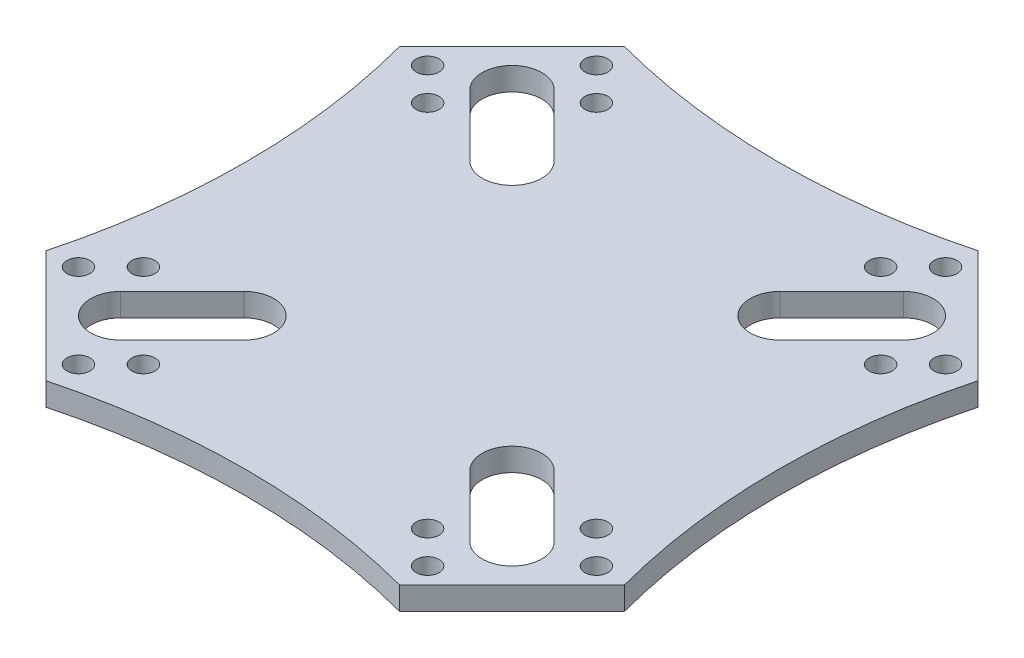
ISO-10303-21;
HEADER;
FILE_DESCRIPTION(('STEP AP214'),'2;1');
FILE_NAME('part.step','',(''),(''),'','','');
FILE_SCHEMA(('AUTOMOTIVE_DESIGN { 1 0 10303 214 1 1 1 1 }'));
ENDSEC;
DATA;
#1=APPLICATION_CONTEXT('core data for automotive mechanical design processes');
#2=APPLICATION_PROTOCOL_DEFINITION('international standard','automotive_design',2000,#1);
#3=PRODUCT_CONTEXT('',#1,'mechanical');
#4=PRODUCT('Part','Part','',(#3));
#5=PRODUCT_RELATED_PRODUCT_CATEGORY('part','',(#4));
#6=PRODUCT_DEFINITION_FORMATION('','',#4);
#7=PRODUCT_DEFINITION_CONTEXT('part definition',#1,'design');
#8=PRODUCT_DEFINITION('design','',#6,#7);
#9=PRODUCT_DEFINITION_SHAPE('','',#8);
#10=(LENGTH_UNIT() NAMED_UNIT(*) SI_UNIT(.MILLI.,.METRE.));
#11=(NAMED_UNIT(*) PLANE_ANGLE_UNIT() SI_UNIT($,.RADIAN.));
#12=(NAMED_UNIT(*) SI_UNIT($,.STERADIAN.) SOLID_ANGLE_UNIT());
#13=UNCERTAINTY_MEASURE_WITH_UNIT(LENGTH_MEASURE(1.E-05),#10,'distance_accuracy_value','');
#14=(GEOMETRIC_REPRESENTATION_CONTEXT(3) GLOBAL_UNCERTAINTY_ASSIGNED_CONTEXT((#13)) GLOBAL_UNIT_ASSIGNED_CONTEXT((#10,
#11,#12)) REPRESENTATION_CONTEXT('',''));
#15=CARTESIAN_POINT('',(0.,0.,0.));
#16=DIRECTION('',(0.,0.,1.));
#17=DIRECTION('',(1.,0.,0.));
#18=AXIS2_PLACEMENT_3D('',#15,#16,#17);
#19=CARTESIAN_POINT('',(0.,2.5,-208.));
#20=DIRECTION('',(0.,1.,0.));
#21=DIRECTION('',(0.,0.,1.));
#22=AXIS2_PLACEMENT_3D('',#19,#20,#21);
#23=PLANE('',#22);
#24=CARTESIAN_POINT('',(56.4193553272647,2.5,38.0345790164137));
#25=DIRECTION('',(0.,1.,0.));
#26=DIRECTION('',(-1.,0.,0.));
#27=AXIS2_PLACEMENT_3D('',#24,#25,#26);
#28=CIRCLE('',#27,2.50000000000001);
#29=CARTESIAN_POINT('',(53.9193553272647,2.5,38.0345790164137));
#30=VERTEX_POINT('',#29);
#31=EDGE_CURVE('E850',#30,#30,#28,.T.);
#32=ORIENTED_EDGE('',*,*,#31,.F.);
#33=EDGE_LOOP('',(#32));
#34=FACE_BOUND('',#33,.T.);
#35=CARTESIAN_POINT('',(38.0345790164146,2.5,56.4193553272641));
#36=DIRECTION('',(0.,1.,0.));
#37=DIRECTION('',(-1.,0.,0.));
#38=AXIS2_PLACEMENT_3D('',#35,#36,#37);
#39=CIRCLE('',#38,2.50000000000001);
#40=CARTESIAN_POINT('',(35.5345790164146,2.5,56.4193553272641));
#41=VERTEX_POINT('',#40);
#42=EDGE_CURVE('E859',#41,#41,#39,.T.);
#43=ORIENTED_EDGE('',*,*,#42,.F.);
#44=EDGE_LOOP('',(#43));
#45=FACE_BOUND('',#44,.T.);
#46=CARTESIAN_POINT('',(49.3482875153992,2.5,30.9635112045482));
#47=DIRECTION('',(0.,1.,0.));
#48=DIRECTION('',(-1.,0.,0.));
#49=AXIS2_PLACEMENT_3D('',#46,#47,#48);
#50=CIRCLE('',#49,2.50000000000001);
#51=CARTESIAN_POINT('',(46.8482875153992,2.5,30.9635112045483));
#52=VERTEX_POINT('',#51);
#53=EDGE_CURVE('E869',#52,#52,#50,.T.);
#54=ORIENTED_EDGE('',*,*,#53,.F.);
#55=EDGE_LOOP('',(#54));
#56=FACE_BOUND('',#55,.T.);
#57=CARTESIAN_POINT('',(30.9635112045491,2.5,49.3482875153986));
#58=DIRECTION('',(0.,1.,0.));
#59=DIRECTION('',(-1.,0.,0.));
#60=AXIS2_PLACEMENT_3D('',#57,#58,#59);
#61=CIRCLE('',#60,2.50000000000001);
#62=CARTESIAN_POINT('',(28.4635112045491,2.5,49.3482875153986));
#63=VERTEX_POINT('',#62);
#64=EDGE_CURVE('E877',#63,#63,#61,.T.);
#65=ORIENTED_EDGE('',*,*,#64,.F.);
#66=EDGE_LOOP('',(#65));
#67=FACE_BOUND('',#66,.T.);
#68=CARTESIAN_POINT('',(-38.0345790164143,2.5,56.4193553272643));
#69=DIRECTION('',(0.,1.,0.));
#70=DIRECTION('',(0.,0.,-1.));
#71=AXIS2_PLACEMENT_3D('',#68,#69,#70);
#72=CIRCLE('',#71,2.50000000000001);
#73=CARTESIAN_POINT('',(-38.0345790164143,2.5,53.9193553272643));
#74=VERTEX_POINT('',#73);
#75=EDGE_CURVE('E886',#74,#74,#72,.T.);
#76=ORIENTED_EDGE('',*,*,#75,.F.);
#77=EDGE_LOOP('',(#76));
#78=FACE_BOUND('',#77,.T.);
#79=CARTESIAN_POINT('',(-56.4193553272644,2.5,38.034579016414));
#80=DIRECTION('',(0.,1.,0.));
#81=DIRECTION('',(0.,0.,-1.));
#82=AXIS2_PLACEMENT_3D('',#79,#80,#81);
#83=CIRCLE('',#82,2.50000000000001);
#84=CARTESIAN_POINT('',(-56.4193553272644,2.5,35.534579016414));
#85=VERTEX_POINT('',#84);
#86=EDGE_CURVE('E894',#85,#85,#83,.T.);
#87=ORIENTED_EDGE('',*,*,#86,.F.);
#88=EDGE_LOOP('',(#87));
#89=FACE_BOUND('',#88,.T.);
#90=CARTESIAN_POINT('',(-30.9635112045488,2.5,49.3482875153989));
#91=DIRECTION('',(0.,1.,0.));
#92=DIRECTION('',(0.,0.,-1.));
#93=AXIS2_PLACEMENT_3D('',#90,#91,#92);
#94=CIRCLE('',#93,2.50000000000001);
#95=CARTESIAN_POINT('',(-30.9635112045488,2.5,46.8482875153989));
#96=VERTEX_POINT('',#95);
#97=EDGE_CURVE('E902',#96,#96,#94,.T.);
#98=ORIENTED_EDGE('',*,*,#97,.F.);
#99=EDGE_LOOP('',(#98));
#100=FACE_BOUND('',#99,.T.);
#101=CARTESIAN_POINT('',(-49.3482875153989,2.5,30.9635112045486));
#102=DIRECTION('',(0.,1.,0.));
#103=DIRECTION('',(0.,0.,-1.));
#104=AXIS2_PLACEMENT_3D('',#101,#102,#103);
#105=CIRCLE('',#104,2.50000000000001);
#106=CARTESIAN_POINT('',(-49.3482875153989,2.5,28.4635112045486));
#107=VERTEX_POINT('',#106);
#108=EDGE_CURVE('E856',#107,#107,#105,.T.);
#109=ORIENTED_EDGE('',*,*,#108,.F.);
#110=EDGE_LOOP('',(#109));
#111=FACE_BOUND('',#110,.T.);
#112=CARTESIAN_POINT('',(-56.4193553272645,2.5,-38.0345790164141));
#113=DIRECTION('',(0.,1.,0.));
#114=DIRECTION('',(1.,0.,0.));
#115=AXIS2_PLACEMENT_3D('',#112,#113,#114);
#116=CIRCLE('',#115,2.50000000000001);
#117=CARTESIAN_POINT('',(-53.9193553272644,2.5,-38.0345790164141));
#118=VERTEX_POINT('',#117);
#119=EDGE_CURVE('E918',#118,#118,#116,.T.);
#120=ORIENTED_EDGE('',*,*,#119,.F.);
#121=EDGE_LOOP('',(#120));
#122=FACE_BOUND('',#121,.T.);
#123=CARTESIAN_POINT('',(-38.0345790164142,2.5,-56.4193553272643));
#124=DIRECTION('',(0.,1.,0.));
#125=DIRECTION('',(1.,0.,0.));
#126=AXIS2_PLACEMENT_3D('',#123,#124,#125);
#127=CIRCLE('',#126,2.50000000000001);
#128=CARTESIAN_POINT('',(-35.5345790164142,2.5,-56.4193553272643));
#129=VERTEX_POINT('',#128);
#130=EDGE_CURVE('E926',#129,#129,#127,.T.);
#131=ORIENTED_EDGE('',*,*,#130,.F.);
#132=EDGE_LOOP('',(#131));
#133=FACE_BOUND('',#132,.T.);
#134=CARTESIAN_POINT('',(-49.348287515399,2.5,-30.9635112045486));
#135=DIRECTION('',(0.,1.,0.));
#136=DIRECTION('',(1.,0.,0.));
#137=AXIS2_PLACEMENT_3D('',#134,#135,#136);
#138=CIRCLE('',#137,2.50000000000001);
#139=CARTESIAN_POINT('',(-46.848287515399,2.5,-30.9635112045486));
#140=VERTEX_POINT('',#139);
#141=EDGE_CURVE('E934',#140,#140,#138,.T.);
#142=ORIENTED_EDGE('',*,*,#141,.F.);
#143=EDGE_LOOP('',(#142));
#144=FACE_BOUND('',#143,.T.);
#145=CARTESIAN_POINT('',(-30.9635112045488,2.5,-49.3482875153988));
#146=DIRECTION('',(0.,1.,0.));
#147=DIRECTION('',(1.,0.,0.));
#148=AXIS2_PLACEMENT_3D('',#145,#146,#147);
#149=CIRCLE('',#148,2.50000000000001);
#150=CARTESIAN_POINT('',(-28.4635112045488,2.5,-49.3482875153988));
#151=VERTEX_POINT('',#150);
#152=EDGE_CURVE('E885',#151,#151,#149,.T.);
#153=ORIENTED_EDGE('',*,*,#152,.F.);
#154=EDGE_LOOP('',(#153));
#155=FACE_BOUND('',#154,.T.);
#156=CARTESIAN_POINT('',(30.9635112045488,2.5,-49.3482875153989));
#157=DIRECTION('',(0.,1.,0.));
#158=DIRECTION('',(0.,0.,1.));
#159=AXIS2_PLACEMENT_3D('',#156,#157,#158);
#160=CIRCLE('',#159,2.50000000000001);
#161=CARTESIAN_POINT('',(30.9635112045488,2.5,-46.8482875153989));
#162=VERTEX_POINT('',#161);
#163=EDGE_CURVE('E950',#162,#162,#160,.T.);
#164=ORIENTED_EDGE('',*,*,#163,.F.);
#165=EDGE_LOOP('',(#164));
#166=FACE_BOUND('',#165,.T.);
#167=CARTESIAN_POINT('',(49.3482875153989,2.5,-30.9635112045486));
#168=DIRECTION('',(0.,1.,0.));
#169=DIRECTION('',(0.,0.,1.));
#170=AXIS2_PLACEMENT_3D('',#167,#168,#169);
#171=CIRCLE('',#170,2.50000000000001);
#172=CARTESIAN_POINT('',(49.3482875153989,2.5,-28.4635112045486));
#173=VERTEX_POINT('',#172);
#174=EDGE_CURVE('E917',#173,#173,#171,.T.);
#175=ORIENTED_EDGE('',*,*,#174,.F.);
#176=EDGE_LOOP('',(#175));
#177=FACE_BOUND('',#176,.T.);
#178=CARTESIAN_POINT('',(38.0345790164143,2.5,-56.4193553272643));
#179=DIRECTION('',(0.,1.,0.));
#180=DIRECTION('',(0.,0.,1.));
#181=AXIS2_PLACEMENT_3D('',#178,#179,#180);
#182=CIRCLE('',#181,2.50000000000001);
#183=CARTESIAN_POINT('',(38.0345790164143,2.5,-53.9193553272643));
#184=VERTEX_POINT('',#183);
#185=EDGE_CURVE('E964',#184,#184,#182,.T.);
#186=ORIENTED_EDGE('',*,*,#185,.F.);
#187=EDGE_LOOP('',(#186));
#188=FACE_BOUND('',#187,.T.);
#189=CARTESIAN_POINT('',(56.4193553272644,2.5,-38.034579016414));
#190=DIRECTION('',(0.,1.,0.));
#191=DIRECTION('',(0.,0.,1.));
#192=AXIS2_PLACEMENT_3D('',#189,#190,#191);
#193=CIRCLE('',#192,2.50000000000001);
#194=CARTESIAN_POINT('',(56.4193553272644,2.5,-35.534579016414));
#195=VERTEX_POINT('',#194);
#196=EDGE_CURVE('E949',#195,#195,#193,.T.);
#197=ORIENTED_EDGE('',*,*,#196,.F.);
#198=EDGE_LOOP('',(#197));
#199=FACE_BOUND('',#198,.T.);
#200=CARTESIAN_POINT('',(0.,2.5,-208.));
#201=DIRECTION('',(0.,-1.,0.));
#202=DIRECTION('',(0.,0.,1.));
#203=AXIS2_PLACEMENT_3D('',#200,#201,#202);
#204=CIRCLE('',#203,150.);
#205=CARTESIAN_POINT('',(38.5,2.5,-63.0250021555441));
#206=VERTEX_POINT('',#205);
#207=CARTESIAN_POINT('',(-38.5,2.5,-63.0250021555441));
#208=VERTEX_POINT('',#207);
#209=EDGE_CURVE('E379',#206,#208,#204,.T.);
#210=ORIENTED_EDGE('',*,*,#209,.T.);
#211=DIRECTION('',(-0.707106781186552,0.,0.707106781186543));
#212=VECTOR('',#211,1.);
#213=CARTESIAN_POINT('',(-63.0250021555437,2.5,-38.5000000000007));
#214=LINE('',#213,#212);
#215=CARTESIAN_POINT('',(-63.0250021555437,2.5,-38.5000000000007));
#216=VERTEX_POINT('',#215);
#217=EDGE_CURVE('E383',#208,#216,#214,.T.);
#218=ORIENTED_EDGE('',*,*,#217,.T.);
#219=CARTESIAN_POINT('',(-208.,2.5,-2.187357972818E-12));
#220=DIRECTION('',(0.,-1.,0.));
#221=DIRECTION('',(0.,0.,1.));
#222=AXIS2_PLACEMENT_3D('',#219,#220,#221);
#223=CIRCLE('',#222,150.);
#224=CARTESIAN_POINT('',(-63.0250021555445,2.5,38.4999999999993));
#225=VERTEX_POINT('',#224);
#226=EDGE_CURVE('E387',#216,#225,#223,.T.);
#227=ORIENTED_EDGE('',*,*,#226,.T.);
#228=DIRECTION('',(0.707106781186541,0.,0.707106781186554));
#229=VECTOR('',#228,1.);
#230=CARTESIAN_POINT('',(-38.5000000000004,2.5,63.0250021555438));
#231=LINE('',#230,#229);
#232=CARTESIAN_POINT('',(-38.5000000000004,2.5,63.0250021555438));
#233=VERTEX_POINT('',#232);
#234=EDGE_CURVE('E390',#225,#233,#231,.T.);
#235=ORIENTED_EDGE('',*,*,#234,.T.);
#236=CARTESIAN_POINT('',(-1.45072151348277E-12,2.5,208.));
#237=DIRECTION('',(0.,-1.,0.));
#238=DIRECTION('',(0.,0.,1.));
#239=AXIS2_PLACEMENT_3D('',#236,#237,#238);
#240=CIRCLE('',#239,150.);
#241=CARTESIAN_POINT('',(38.4999999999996,2.5,63.0250021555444));
#242=VERTEX_POINT('',#241);
#243=EDGE_CURVE('E393',#233,#242,#240,.T.);
#244=ORIENTED_EDGE('',*,*,#243,.T.);
#245=DIRECTION('',(0.707106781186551,0.,-0.707106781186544));
#246=VECTOR('',#245,1.);
#247=CARTESIAN_POINT('',(63.0250021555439,2.5,38.5000000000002));
#248=LINE('',#247,#246);
#249=CARTESIAN_POINT('',(63.0250021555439,2.5,38.5000000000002));
#250=VERTEX_POINT('',#249);
#251=EDGE_CURVE('E396',#242,#250,#248,.T.);
#252=ORIENTED_EDGE('',*,*,#251,.T.);
#253=CARTESIAN_POINT('',(208.,2.5,7.38371182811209E-13));
#254=DIRECTION('',(0.,-1.,0.));
#255=DIRECTION('',(0.,0.,1.));
#256=AXIS2_PLACEMENT_3D('',#253,#254,#255);
#257=CIRCLE('',#256,150.);
#258=CARTESIAN_POINT('',(63.0250021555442,2.5,-38.4999999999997));
#259=VERTEX_POINT('',#258);
#260=EDGE_CURVE('E399',#250,#259,#257,.T.);
#261=ORIENTED_EDGE('',*,*,#260,.T.);
#262=DIRECTION('',(-0.707106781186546,0.,-0.707106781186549));
#263=VECTOR('',#262,1.);
#264=CARTESIAN_POINT('',(38.5,2.5,-63.0250021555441));
#265=LINE('',#264,#263);
#266=EDGE_CURVE('E402',#259,#206,#265,.T.);
#267=ORIENTED_EDGE('',*,*,#266,.T.);
#268=EDGE_LOOP('',(#210,#218,#227,#235,#244,#252,#261,#267));
#269=FACE_BOUND('',#268,.T.);
#270=DIRECTION('',(0.707106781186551,0.,-0.707106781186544));
#271=VECTOR('',#270,1.);
#272=CARTESIAN_POINT('',(33.7919383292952,2.5,-24.5995501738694));
#273=LINE('',#272,#271);
#274=CARTESIAN_POINT('',(33.7919383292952,2.5,-24.5995501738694));
#275=VERTEX_POINT('',#274);
#276=CARTESIAN_POINT('',(47.2269671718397,2.5,-38.0345790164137));
#277=VERTEX_POINT('',#276);
#278=EDGE_CURVE('E339',#275,#277,#273,.T.);
#279=ORIENTED_EDGE('',*,*,#278,.F.);
#280=CARTESIAN_POINT('',(29.1957442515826,2.5,-29.195744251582));
#281=DIRECTION('',(0.,1.,0.));
#282=DIRECTION('',(0.,0.,1.));
#283=AXIS2_PLACEMENT_3D('',#280,#281,#282);
#284=CIRCLE('',#283,6.50000000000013);
#285=CARTESIAN_POINT('',(24.59955017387,2.5,-33.7919383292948));
#286=VERTEX_POINT('',#285);
#287=EDGE_CURVE('E336',#286,#275,#284,.T.);
#288=ORIENTED_EDGE('',*,*,#287,.F.);
#289=DIRECTION('',(-0.707106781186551,0.,0.707106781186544));
#290=VECTOR('',#289,1.);
#291=CARTESIAN_POINT('',(24.59955017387,2.5,-33.7919383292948));
#292=LINE('',#291,#290);
#293=CARTESIAN_POINT('',(38.0345790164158,2.5,-47.2269671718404));
#294=VERTEX_POINT('',#293);
#295=EDGE_CURVE('E347',#294,#286,#292,.T.);
#296=ORIENTED_EDGE('',*,*,#295,.F.);
#297=CARTESIAN_POINT('',(42.6307730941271,2.5,-42.6307730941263));
#298=DIRECTION('',(0.,1.,0.));
#299=DIRECTION('',(0.,0.,1.));
#300=AXIS2_PLACEMENT_3D('',#297,#298,#299);
#301=CIRCLE('',#300,6.50000000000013);
#302=EDGE_CURVE('E343',#277,#294,#301,.T.);
#303=ORIENTED_EDGE('',*,*,#302,.F.);
#304=EDGE_LOOP('',(#279,#288,#296,#303));
#305=FACE_BOUND('',#304,.T.);
#306=DIRECTION('',(0.707106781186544,0.,0.707106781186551));
#307=VECTOR('',#306,1.);
#308=CARTESIAN_POINT('',(24.5995501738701,2.5,33.7919383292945));
#309=LINE('',#308,#307);
#310=CARTESIAN_POINT('',(24.5995501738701,2.5,33.7919383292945));
#311=VERTEX_POINT('',#310);
#312=CARTESIAN_POINT('',(38.034579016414,2.5,47.2269671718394));
#313=VERTEX_POINT('',#312);
#314=EDGE_CURVE('E296',#311,#313,#309,.T.);
#315=ORIENTED_EDGE('',*,*,#314,.F.);
#316=CARTESIAN_POINT('',(29.195744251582,2.5,29.1957442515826));
#317=DIRECTION('',(0.,1.,0.));
#318=DIRECTION('',(0.,0.,1.));
#319=AXIS2_PLACEMENT_3D('',#316,#317,#318);
#320=CIRCLE('',#319,6.49999999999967);
#321=CARTESIAN_POINT('',(33.7919383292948,2.5,24.59955017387));
#322=VERTEX_POINT('',#321);
#323=EDGE_CURVE('E293',#322,#311,#320,.T.);
#324=ORIENTED_EDGE('',*,*,#323,.F.);
#325=DIRECTION('',(-0.707106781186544,0.,-0.707106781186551));
#326=VECTOR('',#325,1.);
#327=CARTESIAN_POINT('',(33.7919383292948,2.5,24.59955017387));
#328=LINE('',#327,#326);
#329=CARTESIAN_POINT('',(47.2269671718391,2.5,38.0345790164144));
#330=VERTEX_POINT('',#329);
#331=EDGE_CURVE('E304',#330,#322,#328,.T.);
#332=ORIENTED_EDGE('',*,*,#331,.F.);
#333=CARTESIAN_POINT('',(42.6307730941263,2.5,42.6307730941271));
#334=DIRECTION('',(0.,1.,0.));
#335=DIRECTION('',(0.,0.,1.));
#336=AXIS2_PLACEMENT_3D('',#333,#334,#335);
#337=CIRCLE('',#336,6.49999999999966);
#338=EDGE_CURVE('E300',#313,#330,#337,.T.);
#339=ORIENTED_EDGE('',*,*,#338,.F.);
#340=EDGE_LOOP('',(#315,#324,#332,#339));
#341=FACE_BOUND('',#340,.T.);
#342=DIRECTION('',(-0.707106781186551,0.,0.707106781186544));
#343=VECTOR('',#342,1.);
#344=CARTESIAN_POINT('',(-33.7919383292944,2.5,24.5995501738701));
#345=LINE('',#344,#343);
#346=CARTESIAN_POINT('',(-33.7919383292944,2.5,24.5995501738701));
#347=VERTEX_POINT('',#346);
#348=CARTESIAN_POINT('',(-47.2269671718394,2.5,38.0345790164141));
#349=VERTEX_POINT('',#348);
#350=EDGE_CURVE('E253',#347,#349,#345,.T.);
#351=ORIENTED_EDGE('',*,*,#350,.F.);
#352=CARTESIAN_POINT('',(-29.1957442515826,2.5,29.195744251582));
#353=DIRECTION('',(0.,1.,0.));
#354=DIRECTION('',(0.,0.,1.));
#355=AXIS2_PLACEMENT_3D('',#352,#353,#354);
#356=CIRCLE('',#355,6.49999999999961);
#357=CARTESIAN_POINT('',(-24.5995501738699,2.5,33.7919383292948));
#358=VERTEX_POINT('',#357);
#359=EDGE_CURVE('E250',#358,#347,#356,.T.);
#360=ORIENTED_EDGE('',*,*,#359,.F.);
#361=DIRECTION('',(0.707106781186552,0.,-0.707106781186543));
#362=VECTOR('',#361,1.);
#363=CARTESIAN_POINT('',(-24.5995501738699,2.5,33.7919383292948));
#364=LINE('',#363,#362);
#365=CARTESIAN_POINT('',(-38.0345790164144,2.5,47.2269671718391));
#366=VERTEX_POINT('',#365);
#367=EDGE_CURVE('E261',#366,#358,#364,.T.);
#368=ORIENTED_EDGE('',*,*,#367,.F.);
#369=CARTESIAN_POINT('',(-42.6307730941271,2.5,42.6307730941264));
#370=DIRECTION('',(0.,1.,0.));
#371=DIRECTION('',(0.,0.,1.));
#372=AXIS2_PLACEMENT_3D('',#369,#370,#371);
#373=CIRCLE('',#372,6.49999999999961);
#374=EDGE_CURVE('E257',#349,#366,#373,.T.);
#375=ORIENTED_EDGE('',*,*,#374,.F.);
#376=EDGE_LOOP('',(#351,#360,#368,#375));
#377=FACE_BOUND('',#376,.T.);
#378=DIRECTION('',(-0.707106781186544,0.,-0.707106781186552));
#379=VECTOR('',#378,1.);
#380=CARTESIAN_POINT('',(-24.5995501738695,2.5,-33.7919383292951));
#381=LINE('',#380,#379);
#382=CARTESIAN_POINT('',(-24.5995501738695,2.5,-33.7919383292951));
#383=VERTEX_POINT('',#382);
#384=CARTESIAN_POINT('',(-38.0345790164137,2.5,-47.2269671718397));
#385=VERTEX_POINT('',#384);
#386=EDGE_CURVE('E209',#383,#385,#381,.T.);
#387=ORIENTED_EDGE('',*,*,#386,.F.);
#388=CARTESIAN_POINT('',(-29.195744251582,2.5,-29.1957442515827));
#389=DIRECTION('',(0.,1.,0.));
#390=DIRECTION('',(0.,0.,1.));
#391=AXIS2_PLACEMENT_3D('',#388,#389,#390);
#392=CIRCLE('',#391,6.50000000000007);
#393=CARTESIAN_POINT('',(-33.7919383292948,2.5,-24.59955017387));
#394=VERTEX_POINT('',#393);
#395=EDGE_CURVE('E200',#394,#383,#392,.T.);
#396=ORIENTED_EDGE('',*,*,#395,.F.);
#397=DIRECTION('',(0.707106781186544,0.,0.707106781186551));
#398=VECTOR('',#397,1.);
#399=CARTESIAN_POINT('',(-33.7919383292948,2.5,-24.59955017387));
#400=LINE('',#399,#398);
#401=CARTESIAN_POINT('',(-47.2269671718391,2.5,-38.0345790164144));
#402=VERTEX_POINT('',#401);
#403=EDGE_CURVE('E226',#402,#394,#400,.T.);
#404=ORIENTED_EDGE('',*,*,#403,.F.);
#405=CARTESIAN_POINT('',(-42.6307730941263,2.5,-42.6307730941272));
#406=DIRECTION('',(0.,1.,0.));
#407=DIRECTION('',(0.,0.,1.));
#408=AXIS2_PLACEMENT_3D('',#405,#406,#407);
#409=CIRCLE('',#408,6.50000000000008);
#410=EDGE_CURVE('E222',#385,#402,#409,.T.);
#411=ORIENTED_EDGE('',*,*,#410,.F.);
#412=EDGE_LOOP('',(#387,#396,#404,#411));
#413=FACE_BOUND('',#412,.T.);
#414=ADVANCED_FACE('F38',(#34,#45,#56,#67,#78,#89,#100,#111,#122,#133,#144,#155,#166,#177,#188,
#199,#269,#305,#341,#377,#413),#23,.T.);
#415=CARTESIAN_POINT('',(0.,-2.5,-208.));
#416=DIRECTION('',(0.,1.,0.));
#417=DIRECTION('',(0.,0.,1.));
#418=AXIS2_PLACEMENT_3D('',#415,#416,#417);
#419=PLANE('',#418);
#420=CARTESIAN_POINT('',(56.4193553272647,-2.5,38.0345790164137));
#421=DIRECTION('',(0.,1.,0.));
#422=DIRECTION('',(-1.,0.,0.));
#423=AXIS2_PLACEMENT_3D('',#420,#421,#422);
#424=CIRCLE('',#423,2.50000000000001);
#425=CARTESIAN_POINT('',(53.9193553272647,-2.5,38.0345790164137));
#426=VERTEX_POINT('',#425);
#427=EDGE_CURVE('E848',#426,#426,#424,.T.);
#428=ORIENTED_EDGE('',*,*,#427,.T.);
#429=EDGE_LOOP('',(#428));
#430=FACE_BOUND('',#429,.T.);
#431=CARTESIAN_POINT('',(38.0345790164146,-2.5,56.4193553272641));
#432=DIRECTION('',(0.,1.,0.));
#433=DIRECTION('',(-1.,0.,0.));
#434=AXIS2_PLACEMENT_3D('',#431,#432,#433);
#435=CIRCLE('',#434,2.50000000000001);
#436=CARTESIAN_POINT('',(35.5345790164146,-2.5,56.4193553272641));
#437=VERTEX_POINT('',#436);
#438=EDGE_CURVE('E852',#437,#437,#435,.T.);
#439=ORIENTED_EDGE('',*,*,#438,.T.);
#440=EDGE_LOOP('',(#439));
#441=FACE_BOUND('',#440,.T.);
#442=CARTESIAN_POINT('',(49.3482875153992,-2.5,30.9635112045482));
#443=DIRECTION('',(0.,1.,0.));
#444=DIRECTION('',(-1.,0.,0.));
#445=AXIS2_PLACEMENT_3D('',#442,#443,#444);
#446=CIRCLE('',#445,2.50000000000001);
#447=CARTESIAN_POINT('',(46.8482875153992,-2.5,30.9635112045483));
#448=VERTEX_POINT('',#447);
#449=EDGE_CURVE('E865',#448,#448,#446,.T.);
#450=ORIENTED_EDGE('',*,*,#449,.T.);
#451=EDGE_LOOP('',(#450));
#452=FACE_BOUND('',#451,.T.);
#453=CARTESIAN_POINT('',(30.9635112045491,-2.5,49.3482875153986));
#454=DIRECTION('',(0.,1.,0.));
#455=DIRECTION('',(-1.,0.,0.));
#456=AXIS2_PLACEMENT_3D('',#453,#454,#455);
#457=CIRCLE('',#456,2.50000000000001);
#458=CARTESIAN_POINT('',(28.4635112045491,-2.5,49.3482875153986));
#459=VERTEX_POINT('',#458);
#460=EDGE_CURVE('E873',#459,#459,#457,.T.);
#461=ORIENTED_EDGE('',*,*,#460,.T.);
#462=EDGE_LOOP('',(#461));
#463=FACE_BOUND('',#462,.T.);
#464=CARTESIAN_POINT('',(-38.0345790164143,-2.5,56.4193553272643));
#465=DIRECTION('',(0.,1.,0.));
#466=DIRECTION('',(0.,0.,-1.));
#467=AXIS2_PLACEMENT_3D('',#464,#465,#466);
#468=CIRCLE('',#467,2.50000000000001);
#469=CARTESIAN_POINT('',(-38.0345790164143,-2.5,53.9193553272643));
#470=VERTEX_POINT('',#469);
#471=EDGE_CURVE('E881',#470,#470,#468,.T.);
#472=ORIENTED_EDGE('',*,*,#471,.T.);
#473=EDGE_LOOP('',(#472));
#474=FACE_BOUND('',#473,.T.);
#475=CARTESIAN_POINT('',(-56.4193553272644,-2.5,38.034579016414));
#476=DIRECTION('',(0.,1.,0.));
#477=DIRECTION('',(0.,0.,-1.));
#478=AXIS2_PLACEMENT_3D('',#475,#476,#477);
#479=CIRCLE('',#478,2.50000000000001);
#480=CARTESIAN_POINT('',(-56.4193553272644,-2.5,35.534579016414));
#481=VERTEX_POINT('',#480);
#482=EDGE_CURVE('E890',#481,#481,#479,.T.);
#483=ORIENTED_EDGE('',*,*,#482,.T.);
#484=EDGE_LOOP('',(#483));
#485=FACE_BOUND('',#484,.T.);
#486=CARTESIAN_POINT('',(-30.9635112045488,-2.5,49.3482875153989));
#487=DIRECTION('',(0.,1.,0.));
#488=DIRECTION('',(0.,0.,-1.));
#489=AXIS2_PLACEMENT_3D('',#486,#487,#488);
#490=CIRCLE('',#489,2.50000000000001);
#491=CARTESIAN_POINT('',(-30.9635112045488,-2.5,46.8482875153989));
#492=VERTEX_POINT('',#491);
#493=EDGE_CURVE('E898',#492,#492,#490,.T.);
#494=ORIENTED_EDGE('',*,*,#493,.T.);
#495=EDGE_LOOP('',(#494));
#496=FACE_BOUND('',#495,.T.);
#497=CARTESIAN_POINT('',(-49.3482875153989,-2.5,30.9635112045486));
#498=DIRECTION('',(0.,1.,0.));
#499=DIRECTION('',(0.,0.,-1.));
#500=AXIS2_PLACEMENT_3D('',#497,#498,#499);
#501=CIRCLE('',#500,2.50000000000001);
#502=CARTESIAN_POINT('',(-49.3482875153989,-2.5,28.4635112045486));
#503=VERTEX_POINT('',#502);
#504=EDGE_CURVE('E906',#503,#503,#501,.T.);
#505=ORIENTED_EDGE('',*,*,#504,.T.);
#506=EDGE_LOOP('',(#505));
#507=FACE_BOUND('',#506,.T.);
#508=CARTESIAN_POINT('',(-56.4193553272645,-2.5,-38.0345790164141));
#509=DIRECTION('',(0.,1.,0.));
#510=DIRECTION('',(1.,0.,0.));
#511=AXIS2_PLACEMENT_3D('',#508,#509,#510);
#512=CIRCLE('',#511,2.50000000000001);
#513=CARTESIAN_POINT('',(-53.9193553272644,-2.5,-38.0345790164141));
#514=VERTEX_POINT('',#513);
#515=EDGE_CURVE('E913',#514,#514,#512,.T.);
#516=ORIENTED_EDGE('',*,*,#515,.T.);
#517=EDGE_LOOP('',(#516));
#518=FACE_BOUND('',#517,.T.);
#519=CARTESIAN_POINT('',(-38.0345790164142,-2.5,-56.4193553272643));
#520=DIRECTION('',(0.,1.,0.));
#521=DIRECTION('',(1.,0.,0.));
#522=AXIS2_PLACEMENT_3D('',#519,#520,#521);
#523=CIRCLE('',#522,2.50000000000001);
#524=CARTESIAN_POINT('',(-35.5345790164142,-2.5,-56.4193553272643));
#525=VERTEX_POINT('',#524);
#526=EDGE_CURVE('E922',#525,#525,#523,.T.);
#527=ORIENTED_EDGE('',*,*,#526,.T.);
#528=EDGE_LOOP('',(#527));
#529=FACE_BOUND('',#528,.T.);
#530=CARTESIAN_POINT('',(-49.348287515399,-2.5,-30.9635112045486));
#531=DIRECTION('',(0.,1.,0.));
#532=DIRECTION('',(1.,0.,0.));
#533=AXIS2_PLACEMENT_3D('',#530,#531,#532);
#534=CIRCLE('',#533,2.50000000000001);
#535=CARTESIAN_POINT('',(-46.848287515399,-2.5,-30.9635112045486));
#536=VERTEX_POINT('',#535);
#537=EDGE_CURVE('E930',#536,#536,#534,.T.);
#538=ORIENTED_EDGE('',*,*,#537,.T.);
#539=EDGE_LOOP('',(#538));
#540=FACE_BOUND('',#539,.T.);
#541=CARTESIAN_POINT('',(-30.9635112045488,-2.5,-49.3482875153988));
#542=DIRECTION('',(0.,1.,0.));
#543=DIRECTION('',(1.,0.,0.));
#544=AXIS2_PLACEMENT_3D('',#541,#542,#543);
#545=CIRCLE('',#544,2.50000000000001);
#546=CARTESIAN_POINT('',(-28.4635112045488,-2.5,-49.3482875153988));
#547=VERTEX_POINT('',#546);
#548=EDGE_CURVE('E938',#547,#547,#545,.T.);
#549=ORIENTED_EDGE('',*,*,#548,.T.);
#550=EDGE_LOOP('',(#549));
#551=FACE_BOUND('',#550,.T.);
#552=CARTESIAN_POINT('',(30.9635112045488,-2.5,-49.3482875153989));
#553=DIRECTION('',(0.,1.,0.));
#554=DIRECTION('',(0.,0.,1.));
#555=AXIS2_PLACEMENT_3D('',#552,#553,#554);
#556=CIRCLE('',#555,2.50000000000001);
#557=CARTESIAN_POINT('',(30.9635112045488,-2.5,-46.8482875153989));
#558=VERTEX_POINT('',#557);
#559=EDGE_CURVE('E945',#558,#558,#556,.T.);
#560=ORIENTED_EDGE('',*,*,#559,.T.);
#561=EDGE_LOOP('',(#560));
#562=FACE_BOUND('',#561,.T.);
#563=CARTESIAN_POINT('',(49.3482875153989,-2.5,-30.9635112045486));
#564=DIRECTION('',(0.,1.,0.));
#565=DIRECTION('',(0.,0.,1.));
#566=AXIS2_PLACEMENT_3D('',#563,#564,#565);
#567=CIRCLE('',#566,2.50000000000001);
#568=CARTESIAN_POINT('',(49.3482875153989,-2.5,-28.4635112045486));
#569=VERTEX_POINT('',#568);
#570=EDGE_CURVE('E954',#569,#569,#567,.T.);
#571=ORIENTED_EDGE('',*,*,#570,.T.);
#572=EDGE_LOOP('',(#571));
#573=FACE_BOUND('',#572,.T.);
#574=CARTESIAN_POINT('',(38.0345790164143,-2.5,-56.4193553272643));
#575=DIRECTION('',(0.,1.,0.));
#576=DIRECTION('',(0.,0.,1.));
#577=AXIS2_PLACEMENT_3D('',#574,#575,#576);
#578=CIRCLE('',#577,2.50000000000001);
#579=CARTESIAN_POINT('',(38.0345790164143,-2.5,-53.9193553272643));
#580=VERTEX_POINT('',#579);
#581=EDGE_CURVE('E234',#580,#580,#578,.T.);
#582=ORIENTED_EDGE('',*,*,#581,.T.);
#583=EDGE_LOOP('',(#582));
#584=FACE_BOUND('',#583,.T.);
#585=CARTESIAN_POINT('',(56.4193553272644,-2.5,-38.034579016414));
#586=DIRECTION('',(0.,1.,0.));
#587=DIRECTION('',(0.,0.,1.));
#588=AXIS2_PLACEMENT_3D('',#585,#586,#587);
#589=CIRCLE('',#588,2.50000000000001);
#590=CARTESIAN_POINT('',(56.4193553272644,-2.5,-35.534579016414));
#591=VERTEX_POINT('',#590);
#592=EDGE_CURVE('E968',#591,#591,#589,.T.);
#593=ORIENTED_EDGE('',*,*,#592,.T.);
#594=EDGE_LOOP('',(#593));
#595=FACE_BOUND('',#594,.T.);
#596=CARTESIAN_POINT('',(-29.1957442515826,-2.5,29.195744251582));
#597=DIRECTION('',(0.,1.,0.));
#598=DIRECTION('',(0.,0.,1.));
#599=AXIS2_PLACEMENT_3D('',#596,#597,#598);
#600=CIRCLE('',#599,6.49999999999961);
#601=CARTESIAN_POINT('',(-24.5995501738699,-2.5,33.7919383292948));
#602=VERTEX_POINT('',#601);
#603=CARTESIAN_POINT('',(-33.7919383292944,-2.5,24.5995501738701));
#604=VERTEX_POINT('',#603);
#605=EDGE_CURVE('E218',#602,#604,#600,.T.);
#606=ORIENTED_EDGE('',*,*,#605,.T.);
#607=DIRECTION('',(-0.707106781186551,0.,0.707106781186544));
#608=VECTOR('',#607,1.);
#609=CARTESIAN_POINT('',(-33.7919383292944,-2.5,24.5995501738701));
#610=LINE('',#609,#608);
#611=CARTESIAN_POINT('',(-47.2269671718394,-2.5,38.0345790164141));
#612=VERTEX_POINT('',#611);
#613=EDGE_CURVE('E268',#604,#612,#610,.T.);
#614=ORIENTED_EDGE('',*,*,#613,.T.);
#615=CARTESIAN_POINT('',(-42.6307730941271,-2.5,42.6307730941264));
#616=DIRECTION('',(0.,1.,0.));
#617=DIRECTION('',(0.,0.,1.));
#618=AXIS2_PLACEMENT_3D('',#615,#616,#617);
#619=CIRCLE('',#618,6.49999999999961);
#620=CARTESIAN_POINT('',(-38.0345790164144,-2.5,47.2269671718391));
#621=VERTEX_POINT('',#620);
#622=EDGE_CURVE('E272',#612,#621,#619,.T.);
#623=ORIENTED_EDGE('',*,*,#622,.T.);
#624=DIRECTION('',(0.707106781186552,0.,-0.707106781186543));
#625=VECTOR('',#624,1.);
#626=CARTESIAN_POINT('',(-24.5995501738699,-2.5,33.7919383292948));
#627=LINE('',#626,#625);
#628=EDGE_CURVE('E254',#621,#602,#627,.T.);
#629=ORIENTED_EDGE('',*,*,#628,.T.);
#630=EDGE_LOOP('',(#606,#614,#623,#629));
#631=FACE_BOUND('',#630,.T.);
#632=CARTESIAN_POINT('',(29.1957442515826,-2.5,-29.195744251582));
#633=DIRECTION('',(0.,1.,0.));
#634=DIRECTION('',(0.,0.,1.));
#635=AXIS2_PLACEMENT_3D('',#632,#633,#634);
#636=CIRCLE('',#635,6.50000000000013);
#637=CARTESIAN_POINT('',(24.59955017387,-2.5,-33.7919383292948));
#638=VERTEX_POINT('',#637);
#639=CARTESIAN_POINT('',(33.7919383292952,-2.5,-24.5995501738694));
#640=VERTEX_POINT('',#639);
#641=EDGE_CURVE('E335',#638,#640,#636,.T.);
#642=ORIENTED_EDGE('',*,*,#641,.T.);
#643=DIRECTION('',(0.707106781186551,0.,-0.707106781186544));
#644=VECTOR('',#643,1.);
#645=CARTESIAN_POINT('',(33.7919383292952,-2.5,-24.5995501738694));
#646=LINE('',#645,#644);
#647=CARTESIAN_POINT('',(47.2269671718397,-2.5,-38.0345790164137));
#648=VERTEX_POINT('',#647);
#649=EDGE_CURVE('E354',#640,#648,#646,.T.);
#650=ORIENTED_EDGE('',*,*,#649,.T.);
#651=CARTESIAN_POINT('',(42.6307730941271,-2.5,-42.6307730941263));
#652=DIRECTION('',(0.,1.,0.));
#653=DIRECTION('',(0.,0.,1.));
#654=AXIS2_PLACEMENT_3D('',#651,#652,#653);
#655=CIRCLE('',#654,6.50000000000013);
#656=CARTESIAN_POINT('',(38.0345790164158,-2.5,-47.2269671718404));
#657=VERTEX_POINT('',#656);
#658=EDGE_CURVE('E358',#648,#657,#655,.T.);
#659=ORIENTED_EDGE('',*,*,#658,.T.);
#660=DIRECTION('',(-0.707106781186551,0.,0.707106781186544));
#661=VECTOR('',#660,1.);
#662=CARTESIAN_POINT('',(24.59955017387,-2.5,-33.7919383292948));
#663=LINE('',#662,#661);
#664=EDGE_CURVE('E340',#657,#638,#663,.T.);
#665=ORIENTED_EDGE('',*,*,#664,.T.);
#666=EDGE_LOOP('',(#642,#650,#659,#665));
#667=FACE_BOUND('',#666,.T.);
#668=CARTESIAN_POINT('',(0.,-2.5,-208.));
#669=DIRECTION('',(0.,-1.,0.));
#670=DIRECTION('',(0.,0.,1.));
#671=AXIS2_PLACEMENT_3D('',#668,#669,#670);
#672=CIRCLE('',#671,150.);
#673=CARTESIAN_POINT('',(38.5,-2.5,-63.0250021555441));
#674=VERTEX_POINT('',#673);
#675=CARTESIAN_POINT('',(-38.5,-2.5,-63.0250021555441));
#676=VERTEX_POINT('',#675);
#677=EDGE_CURVE('E378',#674,#676,#672,.T.);
#678=ORIENTED_EDGE('',*,*,#677,.F.);
#679=DIRECTION('',(-0.707106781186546,0.,-0.707106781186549));
#680=VECTOR('',#679,1.);
#681=CARTESIAN_POINT('',(38.5,-2.5,-63.0250021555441));
#682=LINE('',#681,#680);
#683=CARTESIAN_POINT('',(63.0250021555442,-2.5,-38.4999999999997));
#684=VERTEX_POINT('',#683);
#685=EDGE_CURVE('E384',#684,#674,#682,.T.);
#686=ORIENTED_EDGE('',*,*,#685,.F.);
#687=CARTESIAN_POINT('',(208.,-2.5,7.38371182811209E-13));
#688=DIRECTION('',(0.,-1.,0.));
#689=DIRECTION('',(0.,0.,1.));
#690=AXIS2_PLACEMENT_3D('',#687,#688,#689);
#691=CIRCLE('',#690,150.);
#692=CARTESIAN_POINT('',(63.0250021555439,-2.5,38.5000000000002));
#693=VERTEX_POINT('',#692);
#694=EDGE_CURVE('E424',#693,#684,#691,.T.);
#695=ORIENTED_EDGE('',*,*,#694,.F.);
#696=DIRECTION('',(0.707106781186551,0.,-0.707106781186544));
#697=VECTOR('',#696,1.);
#698=CARTESIAN_POINT('',(63.0250021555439,-2.5,38.5000000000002));
#699=LINE('',#698,#697);
#700=CARTESIAN_POINT('',(38.4999999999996,-2.5,63.0250021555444));
#701=VERTEX_POINT('',#700);
#702=EDGE_CURVE('E421',#701,#693,#699,.T.);
#703=ORIENTED_EDGE('',*,*,#702,.F.);
#704=CARTESIAN_POINT('',(-1.45072151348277E-12,-2.5,208.));
#705=DIRECTION('',(0.,-1.,0.));
#706=DIRECTION('',(0.,0.,1.));
#707=AXIS2_PLACEMENT_3D('',#704,#705,#706);
#708=CIRCLE('',#707,150.);
#709=CARTESIAN_POINT('',(-38.5000000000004,-2.5,63.0250021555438));
#710=VERTEX_POINT('',#709);
#711=EDGE_CURVE('E418',#710,#701,#708,.T.);
#712=ORIENTED_EDGE('',*,*,#711,.F.);
#713=DIRECTION('',(0.707106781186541,0.,0.707106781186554));
#714=VECTOR('',#713,1.);
#715=CARTESIAN_POINT('',(-38.5000000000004,-2.5,63.0250021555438));
#716=LINE('',#715,#714);
#717=CARTESIAN_POINT('',(-63.0250021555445,-2.5,38.4999999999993));
#718=VERTEX_POINT('',#717);
#719=EDGE_CURVE('E415',#718,#710,#716,.T.);
#720=ORIENTED_EDGE('',*,*,#719,.F.);
#721=CARTESIAN_POINT('',(-208.,-2.5,-2.187357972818E-12));
#722=DIRECTION('',(0.,-1.,0.));
#723=DIRECTION('',(0.,0.,1.));
#724=AXIS2_PLACEMENT_3D('',#721,#722,#723);
#725=CIRCLE('',#724,150.);
#726=CARTESIAN_POINT('',(-63.0250021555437,-2.5,-38.5000000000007));
#727=VERTEX_POINT('',#726);
#728=EDGE_CURVE('E412',#727,#718,#725,.T.);
#729=ORIENTED_EDGE('',*,*,#728,.F.);
#730=DIRECTION('',(-0.707106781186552,0.,0.707106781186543));
#731=VECTOR('',#730,1.);
#732=CARTESIAN_POINT('',(-63.0250021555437,-2.5,-38.5000000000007));
#733=LINE('',#732,#731);
#734=EDGE_CURVE('E409',#676,#727,#733,.T.);
#735=ORIENTED_EDGE('',*,*,#734,.F.);
#736=EDGE_LOOP('',(#678,#686,#695,#703,#712,#720,#729,#735));
#737=FACE_BOUND('',#736,.T.);
#738=CARTESIAN_POINT('',(29.195744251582,-2.5,29.1957442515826));
#739=DIRECTION('',(0.,1.,0.));
#740=DIRECTION('',(0.,0.,1.));
#741=AXIS2_PLACEMENT_3D('',#738,#739,#740);
#742=CIRCLE('',#741,6.49999999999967);
#743=CARTESIAN_POINT('',(33.7919383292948,-2.5,24.5995501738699));
#744=VERTEX_POINT('',#743);
#745=CARTESIAN_POINT('',(24.5995501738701,-2.5,33.7919383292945));
#746=VERTEX_POINT('',#745);
#747=EDGE_CURVE('E292',#744,#746,#742,.T.);
#748=ORIENTED_EDGE('',*,*,#747,.T.);
#749=DIRECTION('',(0.707106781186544,0.,0.707106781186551));
#750=VECTOR('',#749,1.);
#751=CARTESIAN_POINT('',(24.5995501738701,-2.5,33.7919383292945));
#752=LINE('',#751,#750);
#753=CARTESIAN_POINT('',(38.034579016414,-2.5,47.2269671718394));
#754=VERTEX_POINT('',#753);
#755=EDGE_CURVE('E311',#746,#754,#752,.T.);
#756=ORIENTED_EDGE('',*,*,#755,.T.);
#757=CARTESIAN_POINT('',(42.6307730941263,-2.5,42.6307730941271));
#758=DIRECTION('',(0.,1.,0.));
#759=DIRECTION('',(0.,0.,1.));
#760=AXIS2_PLACEMENT_3D('',#757,#758,#759);
#761=CIRCLE('',#760,6.49999999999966);
#762=CARTESIAN_POINT('',(47.2269671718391,-2.5,38.0345790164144));
#763=VERTEX_POINT('',#762);
#764=EDGE_CURVE('E315',#754,#763,#761,.T.);
#765=ORIENTED_EDGE('',*,*,#764,.T.);
#766=DIRECTION('',(-0.707106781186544,0.,-0.707106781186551));
#767=VECTOR('',#766,1.);
#768=CARTESIAN_POINT('',(33.7919383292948,-2.5,24.59955017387));
#769=LINE('',#768,#767);
#770=EDGE_CURVE('E297',#763,#744,#769,.T.);
#771=ORIENTED_EDGE('',*,*,#770,.T.);
#772=EDGE_LOOP('',(#748,#756,#765,#771));
#773=FACE_BOUND('',#772,.T.);
#774=CARTESIAN_POINT('',(-29.195744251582,-2.5,-29.1957442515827));
#775=DIRECTION('',(0.,1.,0.));
#776=DIRECTION('',(0.,0.,1.));
#777=AXIS2_PLACEMENT_3D('',#774,#775,#776);
#778=CIRCLE('',#777,6.50000000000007);
#779=CARTESIAN_POINT('',(-33.7919383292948,-2.5,-24.59955017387));
#780=VERTEX_POINT('',#779);
#781=CARTESIAN_POINT('',(-24.5995501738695,-2.5,-33.7919383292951));
#782=VERTEX_POINT('',#781);
#783=EDGE_CURVE('E62',#780,#782,#778,.T.);
#784=ORIENTED_EDGE('',*,*,#783,.T.);
#785=DIRECTION('',(-0.707106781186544,0.,-0.707106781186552));
#786=VECTOR('',#785,1.);
#787=CARTESIAN_POINT('',(-24.5995501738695,-2.5,-33.7919383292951));
#788=LINE('',#787,#786);
#789=CARTESIAN_POINT('',(-38.0345790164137,-2.5,-47.2269671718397));
#790=VERTEX_POINT('',#789);
#791=EDGE_CURVE('E216',#782,#790,#788,.T.);
#792=ORIENTED_EDGE('',*,*,#791,.T.);
#793=CARTESIAN_POINT('',(-42.6307730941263,-2.5,-42.6307730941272));
#794=DIRECTION('',(0.,1.,0.));
#795=DIRECTION('',(0.,0.,1.));
#796=AXIS2_PLACEMENT_3D('',#793,#794,#795);
#797=CIRCLE('',#796,6.50000000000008);
#798=CARTESIAN_POINT('',(-47.2269671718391,-2.5,-38.0345790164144));
#799=VERTEX_POINT('',#798);
#800=EDGE_CURVE('E237',#790,#799,#797,.T.);
#801=ORIENTED_EDGE('',*,*,#800,.T.);
#802=DIRECTION('',(0.707106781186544,0.,0.707106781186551));
#803=VECTOR('',#802,1.);
#804=CARTESIAN_POINT('',(-33.7919383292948,-2.5,-24.59955017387));
#805=LINE('',#804,#803);
#806=EDGE_CURVE('E210',#799,#780,#805,.T.);
#807=ORIENTED_EDGE('',*,*,#806,.T.);
#808=EDGE_LOOP('',(#784,#792,#801,#807));
#809=FACE_BOUND('',#808,.T.);
#810=ADVANCED_FACE('F463',(#430,#441,#452,#463,#474,#485,#496,#507,#518,#529,#540,#551,#562,
#573,#584,#595,#631,#667,#737,#773,#809),#419,.F.);
#811=CARTESIAN_POINT('',(0.,2.5,-208.));
#812=DIRECTION('',(0.,-1.,0.));
#813=DIRECTION('',(0.,0.,-1.));
#814=AXIS2_PLACEMENT_3D('',#811,#812,#813);
#815=CYLINDRICAL_SURFACE('',#814,150.);
#816=ORIENTED_EDGE('',*,*,#677,.T.);
#817=DIRECTION('',(0.,-1.,0.));
#818=VECTOR('',#817,1.);
#819=CARTESIAN_POINT('',(-38.5,2.5,-63.0250021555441));
#820=LINE('',#819,#818);
#821=EDGE_CURVE('E11',#208,#676,#820,.T.);
#822=ORIENTED_EDGE('',*,*,#821,.F.);
#823=ORIENTED_EDGE('',*,*,#209,.F.);
#824=DIRECTION('',(0.,-1.,0.));
#825=VECTOR('',#824,1.);
#826=CARTESIAN_POINT('',(38.5,2.5,-63.0250021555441));
#827=LINE('',#826,#825);
#828=EDGE_CURVE('E405',#206,#674,#827,.T.);
#829=ORIENTED_EDGE('',*,*,#828,.T.);
#830=EDGE_LOOP('',(#816,#822,#823,#829));
#831=FACE_BOUND('',#830,.T.);
#832=ADVANCED_FACE('F40',(#831),#815,.F.);
#833=CARTESIAN_POINT('',(-63.0250021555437,2.5,-38.5000000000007));
#834=DIRECTION('',(0.707106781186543,0.,0.707106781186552));
#835=DIRECTION('',(0.707106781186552,0.,-0.707106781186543));
#836=AXIS2_PLACEMENT_3D('',#833,#834,#835);
#837=PLANE('',#836);
#838=ORIENTED_EDGE('',*,*,#734,.T.);
#839=DIRECTION('',(0.,-1.,0.));
#840=VECTOR('',#839,1.);
#841=CARTESIAN_POINT('',(-63.0250021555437,2.5,-38.5000000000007));
#842=LINE('',#841,#840);
#843=EDGE_CURVE('E47',#216,#727,#842,.T.);
#844=ORIENTED_EDGE('',*,*,#843,.F.);
#845=ORIENTED_EDGE('',*,*,#217,.F.);
#846=ORIENTED_EDGE('',*,*,#821,.T.);
#847=EDGE_LOOP('',(#838,#844,#845,#846));
#848=FACE_BOUND('',#847,.T.);
#849=ADVANCED_FACE('F481',(#848),#837,.F.);
#850=CARTESIAN_POINT('',(-208.,2.5,-2.187357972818E-12));
#851=DIRECTION('',(0.,-1.,0.));
#852=DIRECTION('',(0.,0.,-1.));
#853=AXIS2_PLACEMENT_3D('',#850,#851,#852);
#854=CYLINDRICAL_SURFACE('',#853,150.);
#855=ORIENTED_EDGE('',*,*,#728,.T.);
#856=DIRECTION('',(0.,-1.,0.));
#857=VECTOR('',#856,1.);
#858=CARTESIAN_POINT('',(-63.0250021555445,2.5,38.4999999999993));
#859=LINE('',#858,#857);
#860=EDGE_CURVE('E448',#225,#718,#859,.T.);
#861=ORIENTED_EDGE('',*,*,#860,.F.);
#862=ORIENTED_EDGE('',*,*,#226,.F.);
#863=ORIENTED_EDGE('',*,*,#843,.T.);
#864=EDGE_LOOP('',(#855,#861,#862,#863));
#865=FACE_BOUND('',#864,.T.);
#866=ADVANCED_FACE('F457',(#865),#854,.F.);
#867=CARTESIAN_POINT('',(-38.5000000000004,2.5,63.0250021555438));
#868=DIRECTION('',(0.707106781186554,0.,-0.707106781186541));
#869=DIRECTION('',(-0.707106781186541,0.,-0.707106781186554));
#870=AXIS2_PLACEMENT_3D('',#867,#868,#869);
#871=PLANE('',#870);
#872=ORIENTED_EDGE('',*,*,#719,.T.);
#873=DIRECTION('',(0.,-1.,0.));
#874=VECTOR('',#873,1.);
#875=CARTESIAN_POINT('',(-38.5000000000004,2.5,63.0250021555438));
#876=LINE('',#875,#874);
#877=EDGE_CURVE('E444',#233,#710,#876,.T.);
#878=ORIENTED_EDGE('',*,*,#877,.F.);
#879=ORIENTED_EDGE('',*,*,#234,.F.);
#880=ORIENTED_EDGE('',*,*,#860,.T.);
#881=EDGE_LOOP('',(#872,#878,#879,#880));
#882=FACE_BOUND('',#881,.T.);
#883=ADVANCED_FACE('F469',(#882),#871,.F.);
#884=CARTESIAN_POINT('',(-1.45072151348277E-12,2.5,208.));
#885=DIRECTION('',(0.,-1.,0.));
#886=DIRECTION('',(0.,0.,-1.));
#887=AXIS2_PLACEMENT_3D('',#884,#885,#886);
#888=CYLINDRICAL_SURFACE('',#887,150.);
#889=ORIENTED_EDGE('',*,*,#711,.T.);
#890=DIRECTION('',(0.,-1.,0.));
#891=VECTOR('',#890,1.);
#892=CARTESIAN_POINT('',(38.4999999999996,2.5,63.0250021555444));
#893=LINE('',#892,#891);
#894=EDGE_CURVE('E440',#242,#701,#893,.T.);
#895=ORIENTED_EDGE('',*,*,#894,.F.);
#896=ORIENTED_EDGE('',*,*,#243,.F.);
#897=ORIENTED_EDGE('',*,*,#877,.T.);
#898=EDGE_LOOP('',(#889,#895,#896,#897));
#899=FACE_BOUND('',#898,.T.);
#900=ADVANCED_FACE('F473',(#899),#888,.F.);
#901=CARTESIAN_POINT('',(63.0250021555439,2.5,38.5000000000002));
#902=DIRECTION('',(-0.707106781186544,0.,-0.707106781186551));
#903=DIRECTION('',(-0.707106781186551,0.,0.707106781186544));
#904=AXIS2_PLACEMENT_3D('',#901,#902,#903);
#905=PLANE('',#904);
#906=ORIENTED_EDGE('',*,*,#702,.T.);
#907=DIRECTION('',(0.,-1.,0.));
#908=VECTOR('',#907,1.);
#909=CARTESIAN_POINT('',(63.0250021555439,2.5,38.5000000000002));
#910=LINE('',#909,#908);
#911=EDGE_CURVE('E436',#250,#693,#910,.T.);
#912=ORIENTED_EDGE('',*,*,#911,.F.);
#913=ORIENTED_EDGE('',*,*,#251,.F.);
#914=ORIENTED_EDGE('',*,*,#894,.T.);
#915=EDGE_LOOP('',(#906,#912,#913,#914));
#916=FACE_BOUND('',#915,.T.);
#917=ADVANCED_FACE('F494',(#916),#905,.F.);
#918=CARTESIAN_POINT('',(208.,2.5,7.38371182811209E-13));
#919=DIRECTION('',(0.,-1.,0.));
#920=DIRECTION('',(0.,0.,-1.));
#921=AXIS2_PLACEMENT_3D('',#918,#919,#920);
#922=CYLINDRICAL_SURFACE('',#921,150.);
#923=ORIENTED_EDGE('',*,*,#694,.T.);
#924=DIRECTION('',(0.,-1.,0.));
#925=VECTOR('',#924,1.);
#926=CARTESIAN_POINT('',(63.0250021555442,2.5,-38.4999999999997));
#927=LINE('',#926,#925);
#928=EDGE_CURVE('E432',#259,#684,#927,.T.);
#929=ORIENTED_EDGE('',*,*,#928,.F.);
#930=ORIENTED_EDGE('',*,*,#260,.F.);
#931=ORIENTED_EDGE('',*,*,#911,.T.);
#932=EDGE_LOOP('',(#923,#929,#930,#931));
#933=FACE_BOUND('',#932,.T.);
#934=ADVANCED_FACE('F492',(#933),#922,.F.);
#935=CARTESIAN_POINT('',(38.5,2.5,-63.0250021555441));
#936=DIRECTION('',(-0.707106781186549,0.,0.707106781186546));
#937=DIRECTION('',(0.707106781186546,0.,0.707106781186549));
#938=AXIS2_PLACEMENT_3D('',#935,#936,#937);
#939=PLANE('',#938);
#940=ORIENTED_EDGE('',*,*,#685,.T.);
#941=ORIENTED_EDGE('',*,*,#828,.F.);
#942=ORIENTED_EDGE('',*,*,#266,.F.);
#943=ORIENTED_EDGE('',*,*,#928,.T.);
#944=EDGE_LOOP('',(#940,#941,#942,#943));
#945=FACE_BOUND('',#944,.T.);
#946=ADVANCED_FACE('F487',(#945),#939,.F.);
#947=CARTESIAN_POINT('',(29.1957442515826,2.5,-29.195744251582));
#948=DIRECTION('',(0.,-1.,0.));
#949=DIRECTION('',(0.,0.,-1.));
#950=AXIS2_PLACEMENT_3D('',#947,#948,#949);
#951=CYLINDRICAL_SURFACE('',#950,6.50000000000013);
#952=ORIENTED_EDGE('',*,*,#641,.F.);
#953=DIRECTION('',(0.,-1.,0.));
#954=VECTOR('',#953,1.);
#955=CARTESIAN_POINT('',(24.59955017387,2.5,-33.7919383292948));
#956=LINE('',#955,#954);
#957=EDGE_CURVE('E350',#286,#638,#956,.T.);
#958=ORIENTED_EDGE('',*,*,#957,.F.);
#959=ORIENTED_EDGE('',*,*,#287,.T.);
#960=DIRECTION('',(0.,-1.,0.));
#961=VECTOR('',#960,1.);
#962=CARTESIAN_POINT('',(33.7919383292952,2.5,-24.5995501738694));
#963=LINE('',#962,#961);
#964=EDGE_CURVE('E374',#275,#640,#963,.T.);
#965=ORIENTED_EDGE('',*,*,#964,.T.);
#966=EDGE_LOOP('',(#952,#958,#959,#965));
#967=FACE_BOUND('',#966,.T.);
#968=ADVANCED_FACE('F514',(#967),#951,.F.);
#969=CARTESIAN_POINT('',(33.7919383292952,2.5,-24.5995501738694));
#970=DIRECTION('',(-0.707106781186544,0.,-0.707106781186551));
#971=DIRECTION('',(-0.707106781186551,0.,0.707106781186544));
#972=AXIS2_PLACEMENT_3D('',#969,#970,#971);
#973=PLANE('',#972);
#974=ORIENTED_EDGE('',*,*,#649,.F.);
#975=ORIENTED_EDGE('',*,*,#964,.F.);
#976=ORIENTED_EDGE('',*,*,#278,.T.);
#977=DIRECTION('',(0.,-1.,0.));
#978=VECTOR('',#977,1.);
#979=CARTESIAN_POINT('',(47.2269671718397,2.5,-38.0345790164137));
#980=LINE('',#979,#978);
#981=EDGE_CURVE('E371',#277,#648,#980,.T.);
#982=ORIENTED_EDGE('',*,*,#981,.T.);
#983=EDGE_LOOP('',(#974,#975,#976,#982));
#984=FACE_BOUND('',#983,.T.);
#985=ADVANCED_FACE('F521',(#984),#973,.T.);
#986=CARTESIAN_POINT('',(42.6307730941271,2.5,-42.6307730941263));
#987=DIRECTION('',(0.,-1.,0.));
#988=DIRECTION('',(0.,0.,-1.));
#989=AXIS2_PLACEMENT_3D('',#986,#987,#988);
#990=CYLINDRICAL_SURFACE('',#989,6.50000000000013);
#991=ORIENTED_EDGE('',*,*,#658,.F.);
#992=ORIENTED_EDGE('',*,*,#981,.F.);
#993=ORIENTED_EDGE('',*,*,#302,.T.);
#994=DIRECTION('',(0.,-1.,0.));
#995=VECTOR('',#994,1.);
#996=CARTESIAN_POINT('',(38.0345790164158,2.5,-47.2269671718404));
#997=LINE('',#996,#995);
#998=EDGE_CURVE('E368',#294,#657,#997,.T.);
#999=ORIENTED_EDGE('',*,*,#998,.T.);
#1000=EDGE_LOOP('',(#991,#992,#993,#999));
#1001=FACE_BOUND('',#1000,.T.);
#1002=ADVANCED_FACE('F526',(#1001),#990,.F.);
#1003=CARTESIAN_POINT('',(24.59955017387,2.5,-33.7919383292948));
#1004=DIRECTION('',(0.707106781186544,0.,0.707106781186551));
#1005=DIRECTION('',(0.707106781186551,0.,-0.707106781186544));
#1006=AXIS2_PLACEMENT_3D('',#1003,#1004,#1005);
#1007=PLANE('',#1006);
#1008=ORIENTED_EDGE('',*,*,#664,.F.);
#1009=ORIENTED_EDGE('',*,*,#998,.F.);
#1010=ORIENTED_EDGE('',*,*,#295,.T.);
#1011=ORIENTED_EDGE('',*,*,#957,.T.);
#1012=EDGE_LOOP('',(#1008,#1009,#1010,#1011));
#1013=FACE_BOUND('',#1012,.T.);
#1014=ADVANCED_FACE('F534',(#1013),#1007,.T.);
#1015=CARTESIAN_POINT('',(29.195744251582,2.5,29.1957442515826));
#1016=DIRECTION('',(0.,-1.,0.));
#1017=DIRECTION('',(0.,0.,-1.));
#1018=AXIS2_PLACEMENT_3D('',#1015,#1016,#1017);
#1019=CYLINDRICAL_SURFACE('',#1018,6.49999999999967);
#1020=ORIENTED_EDGE('',*,*,#747,.F.);
#1021=DIRECTION('',(0.,-1.,0.));
#1022=VECTOR('',#1021,1.);
#1023=CARTESIAN_POINT('',(33.7919383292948,2.5,24.59955017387));
#1024=LINE('',#1023,#1022);
#1025=EDGE_CURVE('E307',#322,#744,#1024,.T.);
#1026=ORIENTED_EDGE('',*,*,#1025,.F.);
#1027=ORIENTED_EDGE('',*,*,#323,.T.);
#1028=DIRECTION('',(0.,-1.,0.));
#1029=VECTOR('',#1028,1.);
#1030=CARTESIAN_POINT('',(24.5995501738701,2.5,33.7919383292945));
#1031=LINE('',#1030,#1029);
#1032=EDGE_CURVE('E331',#311,#746,#1031,.T.);
#1033=ORIENTED_EDGE('',*,*,#1032,.T.);
#1034=EDGE_LOOP('',(#1020,#1026,#1027,#1033));
#1035=FACE_BOUND('',#1034,.T.);
#1036=ADVANCED_FACE('F589',(#1035),#1019,.F.);
#1037=CARTESIAN_POINT('',(24.5995501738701,2.5,33.7919383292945));
#1038=DIRECTION('',(0.707106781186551,0.,-0.707106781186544));
#1039=DIRECTION('',(-0.707106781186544,0.,-0.707106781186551));
#1040=AXIS2_PLACEMENT_3D('',#1037,#1038,#1039);
#1041=PLANE('',#1040);
#1042=ORIENTED_EDGE('',*,*,#755,.F.);
#1043=ORIENTED_EDGE('',*,*,#1032,.F.);
#1044=ORIENTED_EDGE('',*,*,#314,.T.);
#1045=DIRECTION('',(0.,-1.,0.));
#1046=VECTOR('',#1045,1.);
#1047=CARTESIAN_POINT('',(38.034579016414,2.5,47.2269671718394));
#1048=LINE('',#1047,#1046);
#1049=EDGE_CURVE('E328',#313,#754,#1048,.T.);
#1050=ORIENTED_EDGE('',*,*,#1049,.T.);
#1051=EDGE_LOOP('',(#1042,#1043,#1044,#1050));
#1052=FACE_BOUND('',#1051,.T.);
#1053=ADVANCED_FACE('F585',(#1052),#1041,.T.);
#1054=CARTESIAN_POINT('',(42.6307730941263,2.5,42.6307730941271));
#1055=DIRECTION('',(0.,-1.,0.));
#1056=DIRECTION('',(0.,0.,-1.));
#1057=AXIS2_PLACEMENT_3D('',#1054,#1055,#1056);
#1058=CYLINDRICAL_SURFACE('',#1057,6.49999999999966);
#1059=ORIENTED_EDGE('',*,*,#764,.F.);
#1060=ORIENTED_EDGE('',*,*,#1049,.F.);
#1061=ORIENTED_EDGE('',*,*,#338,.T.);
#1062=DIRECTION('',(0.,-1.,0.));
#1063=VECTOR('',#1062,1.);
#1064=CARTESIAN_POINT('',(47.2269671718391,2.5,38.0345790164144));
#1065=LINE('',#1064,#1063);
#1066=EDGE_CURVE('E325',#330,#763,#1065,.T.);
#1067=ORIENTED_EDGE('',*,*,#1066,.T.);
#1068=EDGE_LOOP('',(#1059,#1060,#1061,#1067));
#1069=FACE_BOUND('',#1068,.T.);
#1070=ADVANCED_FACE('F581',(#1069),#1058,.F.);
#1071=CARTESIAN_POINT('',(33.7919383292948,2.5,24.59955017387));
#1072=DIRECTION('',(-0.707106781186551,0.,0.707106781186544));
#1073=DIRECTION('',(0.707106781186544,0.,0.707106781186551));
#1074=AXIS2_PLACEMENT_3D('',#1071,#1072,#1073);
#1075=PLANE('',#1074);
#1076=ORIENTED_EDGE('',*,*,#770,.F.);
#1077=ORIENTED_EDGE('',*,*,#1066,.F.);
#1078=ORIENTED_EDGE('',*,*,#331,.T.);
#1079=ORIENTED_EDGE('',*,*,#1025,.T.);
#1080=EDGE_LOOP('',(#1076,#1077,#1078,#1079));
#1081=FACE_BOUND('',#1080,.T.);
#1082=ADVANCED_FACE('F578',(#1081),#1075,.T.);
#1083=CARTESIAN_POINT('',(-29.1957442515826,2.5,29.195744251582));
#1084=DIRECTION('',(0.,-1.,0.));
#1085=DIRECTION('',(0.,0.,-1.));
#1086=AXIS2_PLACEMENT_3D('',#1083,#1084,#1085);
#1087=CYLINDRICAL_SURFACE('',#1086,6.49999999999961);
#1088=ORIENTED_EDGE('',*,*,#605,.F.);
#1089=DIRECTION('',(0.,-1.,0.));
#1090=VECTOR('',#1089,1.);
#1091=CARTESIAN_POINT('',(-24.5995501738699,2.5,33.7919383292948));
#1092=LINE('',#1091,#1090);
#1093=EDGE_CURVE('E264',#358,#602,#1092,.T.);
#1094=ORIENTED_EDGE('',*,*,#1093,.F.);
#1095=ORIENTED_EDGE('',*,*,#359,.T.);
#1096=DIRECTION('',(0.,-1.,0.));
#1097=VECTOR('',#1096,1.);
#1098=CARTESIAN_POINT('',(-33.7919383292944,2.5,24.5995501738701));
#1099=LINE('',#1098,#1097);
#1100=EDGE_CURVE('E288',#347,#604,#1099,.T.);
#1101=ORIENTED_EDGE('',*,*,#1100,.T.);
#1102=EDGE_LOOP('',(#1088,#1094,#1095,#1101));
#1103=FACE_BOUND('',#1102,.T.);
#1104=ADVANCED_FACE('F560',(#1103),#1087,.F.);
#1105=CARTESIAN_POINT('',(-33.7919383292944,2.5,24.5995501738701));
#1106=DIRECTION('',(0.707106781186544,0.,0.707106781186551));
#1107=DIRECTION('',(0.707106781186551,0.,-0.707106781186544));
#1108=AXIS2_PLACEMENT_3D('',#1105,#1106,#1107);
#1109=PLANE('',#1108);
#1110=ORIENTED_EDGE('',*,*,#613,.F.);
#1111=ORIENTED_EDGE('',*,*,#1100,.F.);
#1112=ORIENTED_EDGE('',*,*,#350,.T.);
#1113=DIRECTION('',(0.,-1.,0.));
#1114=VECTOR('',#1113,1.);
#1115=CARTESIAN_POINT('',(-47.2269671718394,2.5,38.0345790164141));
#1116=LINE('',#1115,#1114);
#1117=EDGE_CURVE('E285',#349,#612,#1116,.T.);
#1118=ORIENTED_EDGE('',*,*,#1117,.T.);
#1119=EDGE_LOOP('',(#1110,#1111,#1112,#1118));
#1120=FACE_BOUND('',#1119,.T.);
#1121=ADVANCED_FACE('F553',(#1120),#1109,.T.);
#1122=CARTESIAN_POINT('',(-42.6307730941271,2.5,42.6307730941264));
#1123=DIRECTION('',(0.,-1.,0.));
#1124=DIRECTION('',(0.,0.,-1.));
#1125=AXIS2_PLACEMENT_3D('',#1122,#1123,#1124);
#1126=CYLINDRICAL_SURFACE('',#1125,6.49999999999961);
#1127=ORIENTED_EDGE('',*,*,#622,.F.);
#1128=ORIENTED_EDGE('',*,*,#1117,.F.);
#1129=ORIENTED_EDGE('',*,*,#374,.T.);
#1130=DIRECTION('',(0.,-1.,0.));
#1131=VECTOR('',#1130,1.);
#1132=CARTESIAN_POINT('',(-38.0345790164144,2.5,47.2269671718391));
#1133=LINE('',#1132,#1131);
#1134=EDGE_CURVE('E282',#366,#621,#1133,.T.);
#1135=ORIENTED_EDGE('',*,*,#1134,.T.);
#1136=EDGE_LOOP('',(#1127,#1128,#1129,#1135));
#1137=FACE_BOUND('',#1136,.T.);
#1138=ADVANCED_FACE('F556',(#1137),#1126,.F.);
#1139=CARTESIAN_POINT('',(-24.5995501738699,2.5,33.7919383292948));
#1140=DIRECTION('',(-0.707106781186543,0.,-0.707106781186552));
#1141=DIRECTION('',(-0.707106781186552,0.,0.707106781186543));
#1142=AXIS2_PLACEMENT_3D('',#1139,#1140,#1141);
#1143=PLANE('',#1142);
#1144=ORIENTED_EDGE('',*,*,#628,.F.);
#1145=ORIENTED_EDGE('',*,*,#1134,.F.);
#1146=ORIENTED_EDGE('',*,*,#367,.T.);
#1147=ORIENTED_EDGE('',*,*,#1093,.T.);
#1148=EDGE_LOOP('',(#1144,#1145,#1146,#1147));
#1149=FACE_BOUND('',#1148,.T.);
#1150=ADVANCED_FACE('F563',(#1149),#1143,.T.);
#1151=CARTESIAN_POINT('',(-29.195744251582,2.5,-29.1957442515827));
#1152=DIRECTION('',(0.,-1.,0.));
#1153=DIRECTION('',(0.,0.,-1.));
#1154=AXIS2_PLACEMENT_3D('',#1151,#1152,#1153);
#1155=CYLINDRICAL_SURFACE('',#1154,6.50000000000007);
#1156=ORIENTED_EDGE('',*,*,#783,.F.);
#1157=DIRECTION('',(0.,-1.,0.));
#1158=VECTOR('',#1157,1.);
#1159=CARTESIAN_POINT('',(-33.7919383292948,2.5,-24.59955017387));
#1160=LINE('',#1159,#1158);
#1161=EDGE_CURVE('E204',#394,#780,#1160,.T.);
#1162=ORIENTED_EDGE('',*,*,#1161,.F.);
#1163=ORIENTED_EDGE('',*,*,#395,.T.);
#1164=DIRECTION('',(0.,-1.,0.));
#1165=VECTOR('',#1164,1.);
#1166=CARTESIAN_POINT('',(-24.5995501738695,2.5,-33.7919383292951));
#1167=LINE('',#1166,#1165);
#1168=EDGE_CURVE('E203',#383,#782,#1167,.T.);
#1169=ORIENTED_EDGE('',*,*,#1168,.T.);
#1170=EDGE_LOOP('',(#1156,#1162,#1163,#1169));
#1171=FACE_BOUND('',#1170,.T.);
#1172=ADVANCED_FACE('F202',(#1171),#1155,.F.);
#1173=CARTESIAN_POINT('',(-24.5995501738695,2.5,-33.7919383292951));
#1174=DIRECTION('',(-0.707106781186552,0.,0.707106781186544));
#1175=DIRECTION('',(0.707106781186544,0.,0.707106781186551));
#1176=AXIS2_PLACEMENT_3D('',#1173,#1174,#1175);
#1177=PLANE('',#1176);
#1178=ORIENTED_EDGE('',*,*,#791,.F.);
#1179=ORIENTED_EDGE('',*,*,#1168,.F.);
#1180=ORIENTED_EDGE('',*,*,#386,.T.);
#1181=DIRECTION('',(0.,-1.,0.));
#1182=VECTOR('',#1181,1.);
#1183=CARTESIAN_POINT('',(-38.0345790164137,2.5,-47.2269671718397));
#1184=LINE('',#1183,#1182);
#1185=EDGE_CURVE('E219',#385,#790,#1184,.T.);
#1186=ORIENTED_EDGE('',*,*,#1185,.T.);
#1187=EDGE_LOOP('',(#1178,#1179,#1180,#1186));
#1188=FACE_BOUND('',#1187,.T.);
#1189=ADVANCED_FACE('F213',(#1188),#1177,.T.);
#1190=CARTESIAN_POINT('',(-42.6307730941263,2.5,-42.6307730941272));
#1191=DIRECTION('',(0.,-1.,0.));
#1192=DIRECTION('',(0.,0.,-1.));
#1193=AXIS2_PLACEMENT_3D('',#1190,#1191,#1192);
#1194=CYLINDRICAL_SURFACE('',#1193,6.50000000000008);
#1195=ORIENTED_EDGE('',*,*,#800,.F.);
#1196=ORIENTED_EDGE('',*,*,#1185,.F.);
#1197=ORIENTED_EDGE('',*,*,#410,.T.);
#1198=DIRECTION('',(0.,-1.,0.));
#1199=VECTOR('',#1198,1.);
#1200=CARTESIAN_POINT('',(-47.2269671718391,2.5,-38.0345790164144));
#1201=LINE('',#1200,#1199);
#1202=EDGE_CURVE('E54',#402,#799,#1201,.T.);
#1203=ORIENTED_EDGE('',*,*,#1202,.T.);
#1204=EDGE_LOOP('',(#1195,#1196,#1197,#1203));
#1205=FACE_BOUND('',#1204,.T.);
#1206=ADVANCED_FACE('F652',(#1205),#1194,.F.);
#1207=CARTESIAN_POINT('',(-33.7919383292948,2.5,-24.59955017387));
#1208=DIRECTION('',(0.707106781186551,0.,-0.707106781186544));
#1209=DIRECTION('',(-0.707106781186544,0.,-0.707106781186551));
#1210=AXIS2_PLACEMENT_3D('',#1207,#1208,#1209);
#1211=PLANE('',#1210);
#1212=ORIENTED_EDGE('',*,*,#806,.F.);
#1213=ORIENTED_EDGE('',*,*,#1202,.F.);
#1214=ORIENTED_EDGE('',*,*,#403,.T.);
#1215=ORIENTED_EDGE('',*,*,#1161,.T.);
#1216=EDGE_LOOP('',(#1212,#1213,#1214,#1215));
#1217=FACE_BOUND('',#1216,.T.);
#1218=ADVANCED_FACE('F660',(#1217),#1211,.T.);
#1219=CARTESIAN_POINT('',(56.4193553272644,-2.5,-38.034579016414));
#1220=DIRECTION('',(0.,1.,0.));
#1221=DIRECTION('',(0.,0.,1.));
#1222=AXIS2_PLACEMENT_3D('',#1219,#1220,#1221);
#1223=CYLINDRICAL_SURFACE('',#1222,2.50000000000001);
#1224=ORIENTED_EDGE('',*,*,#592,.F.);
#1225=EDGE_LOOP('',(#1224));
#1226=FACE_BOUND('',#1225,.T.);
#1227=ORIENTED_EDGE('',*,*,#196,.T.);
#1228=EDGE_LOOP('',(#1227));
#1229=FACE_BOUND('',#1228,.T.);
#1230=ADVANCED_FACE('F670',(#1226,#1229),#1223,.F.);
#1231=CARTESIAN_POINT('',(38.0345790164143,-2.5,-56.4193553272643));
#1232=DIRECTION('',(0.,1.,0.));
#1233=DIRECTION('',(0.,0.,1.));
#1234=AXIS2_PLACEMENT_3D('',#1231,#1232,#1233);
#1235=CYLINDRICAL_SURFACE('',#1234,2.50000000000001);
#1236=ORIENTED_EDGE('',*,*,#581,.F.);
#1237=EDGE_LOOP('',(#1236));
#1238=FACE_BOUND('',#1237,.T.);
#1239=ORIENTED_EDGE('',*,*,#185,.T.);
#1240=EDGE_LOOP('',(#1239));
#1241=FACE_BOUND('',#1240,.T.);
#1242=ADVANCED_FACE('F679',(#1238,#1241),#1235,.F.);
#1243=CARTESIAN_POINT('',(49.3482875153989,-2.5,-30.9635112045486));
#1244=DIRECTION('',(0.,1.,0.));
#1245=DIRECTION('',(0.,0.,1.));
#1246=AXIS2_PLACEMENT_3D('',#1243,#1244,#1245);
#1247=CYLINDRICAL_SURFACE('',#1246,2.50000000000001);
#1248=ORIENTED_EDGE('',*,*,#570,.F.);
#1249=EDGE_LOOP('',(#1248));
#1250=FACE_BOUND('',#1249,.T.);
#1251=ORIENTED_EDGE('',*,*,#174,.T.);
#1252=EDGE_LOOP('',(#1251));
#1253=FACE_BOUND('',#1252,.T.);
#1254=ADVANCED_FACE('F689',(#1250,#1253),#1247,.F.);
#1255=CARTESIAN_POINT('',(30.9635112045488,-2.5,-49.3482875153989));
#1256=DIRECTION('',(0.,1.,0.));
#1257=DIRECTION('',(0.,0.,1.));
#1258=AXIS2_PLACEMENT_3D('',#1255,#1256,#1257);
#1259=CYLINDRICAL_SURFACE('',#1258,2.50000000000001);
#1260=ORIENTED_EDGE('',*,*,#559,.F.);
#1261=EDGE_LOOP('',(#1260));
#1262=FACE_BOUND('',#1261,.T.);
#1263=ORIENTED_EDGE('',*,*,#163,.T.);
#1264=EDGE_LOOP('',(#1263));
#1265=FACE_BOUND('',#1264,.T.);
#1266=ADVANCED_FACE('F699',(#1262,#1265),#1259,.F.);
#1267=CARTESIAN_POINT('',(-30.9635112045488,-2.5,-49.3482875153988));
#1268=DIRECTION('',(0.,1.,0.));
#1269=DIRECTION('',(0.,0.,1.));
#1270=AXIS2_PLACEMENT_3D('',#1267,#1268,#1269);
#1271=CYLINDRICAL_SURFACE('',#1270,2.50000000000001);
#1272=ORIENTED_EDGE('',*,*,#548,.F.);
#1273=EDGE_LOOP('',(#1272));
#1274=FACE_BOUND('',#1273,.T.);
#1275=ORIENTED_EDGE('',*,*,#152,.T.);
#1276=EDGE_LOOP('',(#1275));
#1277=FACE_BOUND('',#1276,.T.);
#1278=ADVANCED_FACE('F708',(#1274,#1277),#1271,.F.);
#1279=CARTESIAN_POINT('',(-49.348287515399,-2.5,-30.9635112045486));
#1280=DIRECTION('',(0.,1.,0.));
#1281=DIRECTION('',(0.,0.,1.));
#1282=AXIS2_PLACEMENT_3D('',#1279,#1280,#1281);
#1283=CYLINDRICAL_SURFACE('',#1282,2.50000000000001);
#1284=ORIENTED_EDGE('',*,*,#537,.F.);
#1285=EDGE_LOOP('',(#1284));
#1286=FACE_BOUND('',#1285,.T.);
#1287=ORIENTED_EDGE('',*,*,#141,.T.);
#1288=EDGE_LOOP('',(#1287));
#1289=FACE_BOUND('',#1288,.T.);
#1290=ADVANCED_FACE('F731',(#1286,#1289),#1283,.F.);
#1291=CARTESIAN_POINT('',(-38.0345790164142,-2.5,-56.4193553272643));
#1292=DIRECTION('',(0.,1.,0.));
#1293=DIRECTION('',(0.,0.,1.));
#1294=AXIS2_PLACEMENT_3D('',#1291,#1292,#1293);
#1295=CYLINDRICAL_SURFACE('',#1294,2.50000000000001);
#1296=ORIENTED_EDGE('',*,*,#526,.F.);
#1297=EDGE_LOOP('',(#1296));
#1298=FACE_BOUND('',#1297,.T.);
#1299=ORIENTED_EDGE('',*,*,#130,.T.);
#1300=EDGE_LOOP('',(#1299));
#1301=FACE_BOUND('',#1300,.T.);
#1302=ADVANCED_FACE('F741',(#1298,#1301),#1295,.F.);
#1303=CARTESIAN_POINT('',(-56.4193553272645,-2.5,-38.0345790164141));
#1304=DIRECTION('',(0.,1.,0.));
#1305=DIRECTION('',(0.,0.,1.));
#1306=AXIS2_PLACEMENT_3D('',#1303,#1304,#1305);
#1307=CYLINDRICAL_SURFACE('',#1306,2.50000000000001);
#1308=ORIENTED_EDGE('',*,*,#515,.F.);
#1309=EDGE_LOOP('',(#1308));
#1310=FACE_BOUND('',#1309,.T.);
#1311=ORIENTED_EDGE('',*,*,#119,.T.);
#1312=EDGE_LOOP('',(#1311));
#1313=FACE_BOUND('',#1312,.T.);
#1314=ADVANCED_FACE('F751',(#1310,#1313),#1307,.F.);
#1315=CARTESIAN_POINT('',(-49.3482875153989,-2.5,30.9635112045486));
#1316=DIRECTION('',(0.,1.,0.));
#1317=DIRECTION('',(0.,0.,1.));
#1318=AXIS2_PLACEMENT_3D('',#1315,#1316,#1317);
#1319=CYLINDRICAL_SURFACE('',#1318,2.50000000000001);
#1320=ORIENTED_EDGE('',*,*,#504,.F.);
#1321=EDGE_LOOP('',(#1320));
#1322=FACE_BOUND('',#1321,.T.);
#1323=ORIENTED_EDGE('',*,*,#108,.T.);
#1324=EDGE_LOOP('',(#1323));
#1325=FACE_BOUND('',#1324,.T.);
#1326=ADVANCED_FACE('F761',(#1322,#1325),#1319,.F.);
#1327=CARTESIAN_POINT('',(-30.9635112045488,-2.5,49.3482875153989));
#1328=DIRECTION('',(0.,1.,0.));
#1329=DIRECTION('',(0.,0.,1.));
#1330=AXIS2_PLACEMENT_3D('',#1327,#1328,#1329);
#1331=CYLINDRICAL_SURFACE('',#1330,2.50000000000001);
#1332=ORIENTED_EDGE('',*,*,#493,.F.);
#1333=EDGE_LOOP('',(#1332));
#1334=FACE_BOUND('',#1333,.T.);
#1335=ORIENTED_EDGE('',*,*,#97,.T.);
#1336=EDGE_LOOP('',(#1335));
#1337=FACE_BOUND('',#1336,.T.);
#1338=ADVANCED_FACE('F771',(#1334,#1337),#1331,.F.);
#1339=CARTESIAN_POINT('',(-56.4193553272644,-2.5,38.034579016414));
#1340=DIRECTION('',(0.,1.,0.));
#1341=DIRECTION('',(0.,0.,1.));
#1342=AXIS2_PLACEMENT_3D('',#1339,#1340,#1341);
#1343=CYLINDRICAL_SURFACE('',#1342,2.50000000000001);
#1344=ORIENTED_EDGE('',*,*,#482,.F.);
#1345=EDGE_LOOP('',(#1344));
#1346=FACE_BOUND('',#1345,.T.);
#1347=ORIENTED_EDGE('',*,*,#86,.T.);
#1348=EDGE_LOOP('',(#1347));
#1349=FACE_BOUND('',#1348,.T.);
#1350=ADVANCED_FACE('F781',(#1346,#1349),#1343,.F.);
#1351=CARTESIAN_POINT('',(-38.0345790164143,-2.5,56.4193553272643));
#1352=DIRECTION('',(0.,1.,0.));
#1353=DIRECTION('',(0.,0.,1.));
#1354=AXIS2_PLACEMENT_3D('',#1351,#1352,#1353);
#1355=CYLINDRICAL_SURFACE('',#1354,2.50000000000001);
#1356=ORIENTED_EDGE('',*,*,#471,.F.);
#1357=EDGE_LOOP('',(#1356));
#1358=FACE_BOUND('',#1357,.T.);
#1359=ORIENTED_EDGE('',*,*,#75,.T.);
#1360=EDGE_LOOP('',(#1359));
#1361=FACE_BOUND('',#1360,.T.);
#1362=ADVANCED_FACE('F791',(#1358,#1361),#1355,.F.);
#1363=CARTESIAN_POINT('',(30.9635112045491,-2.5,49.3482875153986));
#1364=DIRECTION('',(0.,1.,0.));
#1365=DIRECTION('',(0.,0.,1.));
#1366=AXIS2_PLACEMENT_3D('',#1363,#1364,#1365);
#1367=CYLINDRICAL_SURFACE('',#1366,2.50000000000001);
#1368=ORIENTED_EDGE('',*,*,#460,.F.);
#1369=EDGE_LOOP('',(#1368));
#1370=FACE_BOUND('',#1369,.T.);
#1371=ORIENTED_EDGE('',*,*,#64,.T.);
#1372=EDGE_LOOP('',(#1371));
#1373=FACE_BOUND('',#1372,.T.);
#1374=ADVANCED_FACE('F801',(#1370,#1373),#1367,.F.);
#1375=CARTESIAN_POINT('',(49.3482875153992,-2.5,30.9635112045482));
#1376=DIRECTION('',(0.,1.,0.));
#1377=DIRECTION('',(0.,0.,1.));
#1378=AXIS2_PLACEMENT_3D('',#1375,#1376,#1377);
#1379=CYLINDRICAL_SURFACE('',#1378,2.50000000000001);
#1380=ORIENTED_EDGE('',*,*,#449,.F.);
#1381=EDGE_LOOP('',(#1380));
#1382=FACE_BOUND('',#1381,.T.);
#1383=ORIENTED_EDGE('',*,*,#53,.T.);
#1384=EDGE_LOOP('',(#1383));
#1385=FACE_BOUND('',#1384,.T.);
#1386=ADVANCED_FACE('F811',(#1382,#1385),#1379,.F.);
#1387=CARTESIAN_POINT('',(38.0345790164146,-2.5,56.4193553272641));
#1388=DIRECTION('',(0.,1.,0.));
#1389=DIRECTION('',(0.,0.,1.));
#1390=AXIS2_PLACEMENT_3D('',#1387,#1388,#1389);
#1391=CYLINDRICAL_SURFACE('',#1390,2.50000000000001);
#1392=ORIENTED_EDGE('',*,*,#438,.F.);
#1393=EDGE_LOOP('',(#1392));
#1394=FACE_BOUND('',#1393,.T.);
#1395=ORIENTED_EDGE('',*,*,#42,.T.);
#1396=EDGE_LOOP('',(#1395));
#1397=FACE_BOUND('',#1396,.T.);
#1398=ADVANCED_FACE('F821',(#1394,#1397),#1391,.F.);
#1399=CARTESIAN_POINT('',(56.4193553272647,-2.5,38.0345790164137));
#1400=DIRECTION('',(0.,1.,0.));
#1401=DIRECTION('',(0.,0.,1.));
#1402=AXIS2_PLACEMENT_3D('',#1399,#1400,#1401);
#1403=CYLINDRICAL_SURFACE('',#1402,2.50000000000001);
#1404=ORIENTED_EDGE('',*,*,#427,.F.);
#1405=EDGE_LOOP('',(#1404));
#1406=FACE_BOUND('',#1405,.T.);
#1407=ORIENTED_EDGE('',*,*,#31,.T.);
#1408=EDGE_LOOP('',(#1407));
#1409=FACE_BOUND('',#1408,.T.);
#1410=ADVANCED_FACE('F831',(#1406,#1409),#1403,.F.);
#1411=CLOSED_SHELL('',(#414,#810,#832,#849,#866,#883,#900,#917,#934,#946,#968,#985,#1002,#1014,
#1036,#1053,#1070,#1082,#1104,#1121,#1138,#1150,#1172,#1189,#1206,#1218,#1230,#1242,#1254,#1266,
#1278,#1290,#1302,#1314,#1326,#1338,#1350,#1362,#1374,#1386,#1398,#1410));
#1412=MANIFOLD_SOLID_BREP('B2',#1411);
#1413=ADVANCED_BREP_SHAPE_REPRESENTATION('',(#18,#1412),#14);
#1414=SHAPE_DEFINITION_REPRESENTATION(#9,#1413);
ENDSEC;
END-ISO-10303-21;
